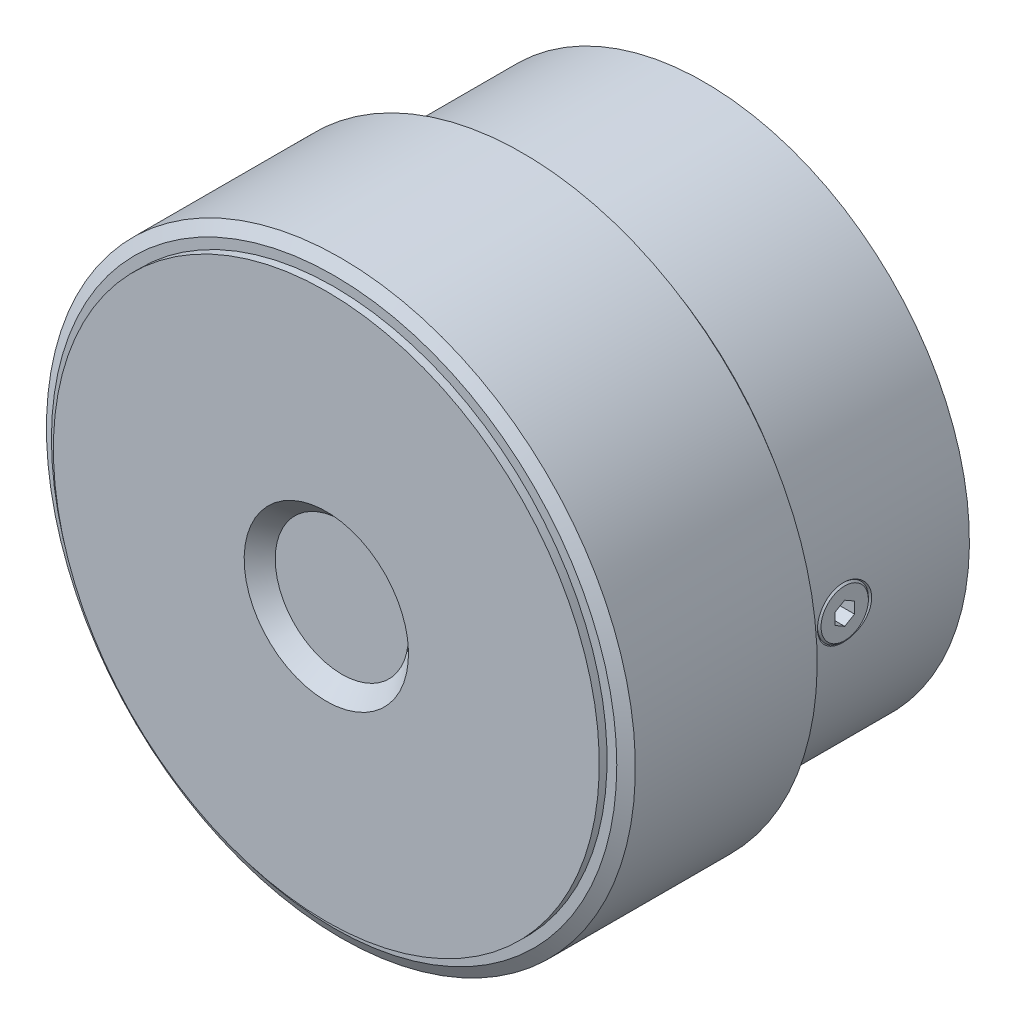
ISO-10303-21;
HEADER;
FILE_DESCRIPTION(('STEP AP214'),'2;1');
FILE_NAME('part.step','',(''),(''),'','','');
FILE_SCHEMA(('AUTOMOTIVE_DESIGN { 1 0 10303 214 1 1 1 1 }'));
ENDSEC;
DATA;
#1=APPLICATION_CONTEXT('core data for automotive mechanical design processes');
#2=APPLICATION_PROTOCOL_DEFINITION('international standard','automotive_design',2000,#1);
#3=PRODUCT_CONTEXT('',#1,'mechanical');
#4=PRODUCT('Part','Part','',(#3));
#5=PRODUCT_RELATED_PRODUCT_CATEGORY('part','',(#4));
#6=PRODUCT_DEFINITION_FORMATION('','',#4);
#7=PRODUCT_DEFINITION_CONTEXT('part definition',#1,'design');
#8=PRODUCT_DEFINITION('design','',#6,#7);
#9=PRODUCT_DEFINITION_SHAPE('','',#8);
#10=(LENGTH_UNIT() NAMED_UNIT(*) SI_UNIT(.MILLI.,.METRE.));
#11=(NAMED_UNIT(*) PLANE_ANGLE_UNIT() SI_UNIT($,.RADIAN.));
#12=(NAMED_UNIT(*) SI_UNIT($,.STERADIAN.) SOLID_ANGLE_UNIT());
#13=UNCERTAINTY_MEASURE_WITH_UNIT(LENGTH_MEASURE(1.E-05),#10,'distance_accuracy_value','');
#14=(GEOMETRIC_REPRESENTATION_CONTEXT(3) GLOBAL_UNCERTAINTY_ASSIGNED_CONTEXT((#13)) GLOBAL_UNIT_ASSIGNED_CONTEXT((#10,
#11,#12)) REPRESENTATION_CONTEXT('',''));
#15=CARTESIAN_POINT('',(0.,0.,0.));
#16=DIRECTION('',(0.,0.,1.));
#17=DIRECTION('',(1.,0.,0.));
#18=AXIS2_PLACEMENT_3D('',#15,#16,#17);
#19=CARTESIAN_POINT('',(0.,0.,22.3094010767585));
#20=DIRECTION('',(0.,0.,1.));
#21=DIRECTION('',(0.,-1.,0.));
#22=AXIS2_PLACEMENT_3D('',#19,#20,#21);
#23=CYLINDRICAL_SURFACE('',#22,4.);
#24=CARTESIAN_POINT('',(0.,0.,0.2));
#25=DIRECTION('',(0.,0.,1.));
#26=DIRECTION('',(0.,-1.,0.));
#27=AXIS2_PLACEMENT_3D('',#24,#25,#26);
#28=CIRCLE('',#27,4.);
#29=CARTESIAN_POINT('',(0.,-4.,0.2));
#30=VERTEX_POINT('',#29);
#31=EDGE_CURVE('E145',#30,#30,#28,.T.);
#32=ORIENTED_EDGE('',*,*,#31,.F.);
#33=EDGE_LOOP('',(#32));
#34=FACE_BOUND('',#33,.T.);
#35=CARTESIAN_POINT('',(0.,0.,20.));
#36=DIRECTION('',(0.,0.,-1.));
#37=DIRECTION('',(0.,1.,0.));
#38=AXIS2_PLACEMENT_3D('',#35,#36,#37);
#39=CIRCLE('',#38,4.);
#40=CARTESIAN_POINT('',(0.,4.,20.));
#41=VERTEX_POINT('',#40);
#42=EDGE_CURVE('E136',#41,#41,#39,.T.);
#43=ORIENTED_EDGE('',*,*,#42,.F.);
#44=EDGE_LOOP('',(#43));
#45=FACE_BOUND('',#44,.T.);
#46=ADVANCED_FACE('F14',(#34,#45),#23,.F.);
#47=CARTESIAN_POINT('',(0.,0.,0.));
#48=DIRECTION('',(0.,0.,-1.));
#49=DIRECTION('',(0.,1.,0.));
#50=AXIS2_PLACEMENT_3D('',#47,#48,#49);
#51=CONICAL_SURFACE('',#50,4.2,0.785398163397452);
#52=ORIENTED_EDGE('',*,*,#31,.T.);
#53=EDGE_LOOP('',(#52));
#54=FACE_BOUND('',#53,.T.);
#55=CARTESIAN_POINT('',(0.,0.,0.));
#56=DIRECTION('',(0.,0.,1.));
#57=DIRECTION('',(0.,-1.,0.));
#58=AXIS2_PLACEMENT_3D('',#55,#56,#57);
#59=CIRCLE('',#58,4.2);
#60=CARTESIAN_POINT('',(0.,-4.2,0.));
#61=VERTEX_POINT('',#60);
#62=EDGE_CURVE('E148',#61,#61,#59,.T.);
#63=ORIENTED_EDGE('',*,*,#62,.F.);
#64=EDGE_LOOP('',(#63));
#65=FACE_BOUND('',#64,.T.);
#66=ADVANCED_FACE('F187',(#54,#65),#51,.F.);
#67=CARTESIAN_POINT('',(0.,0.,0.));
#68=DIRECTION('',(0.,0.,1.));
#69=DIRECTION('',(0.,-1.,0.));
#70=AXIS2_PLACEMENT_3D('',#67,#68,#69);
#71=PLANE('',#70);
#72=CARTESIAN_POINT('',(0.,0.,0.));
#73=DIRECTION('',(0.,0.,1.));
#74=DIRECTION('',(0.,-1.,0.));
#75=AXIS2_PLACEMENT_3D('',#72,#73,#74);
#76=CIRCLE('',#75,7.5);
#77=CARTESIAN_POINT('',(0.,-7.5,0.));
#78=VERTEX_POINT('',#77);
#79=EDGE_CURVE('E98',#78,#78,#76,.T.);
#80=ORIENTED_EDGE('',*,*,#79,.F.);
#81=EDGE_LOOP('',(#80));
#82=FACE_BOUND('',#81,.T.);
#83=ORIENTED_EDGE('',*,*,#62,.T.);
#84=EDGE_LOOP('',(#83));
#85=FACE_BOUND('',#84,.T.);
#86=ADVANCED_FACE('F16',(#82,#85),#71,.F.);
#87=CARTESIAN_POINT('',(20.5,0.,11.5));
#88=DIRECTION('',(1.,0.,0.));
#89=DIRECTION('',(0.,1.,0.));
#90=AXIS2_PLACEMENT_3D('',#87,#88,#89);
#91=PLANE('',#90);
#92=DIRECTION('',(0.,1.,0.));
#93=VECTOR('',#92,1.);
#94=CARTESIAN_POINT('',(20.5,-0.48112522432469,10.6666666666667));
#95=LINE('',#94,#93);
#96=CARTESIAN_POINT('',(20.5,-0.48112522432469,10.6666666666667));
#97=VERTEX_POINT('',#96);
#98=CARTESIAN_POINT('',(20.5,0.481125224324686,10.6666666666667));
#99=VERTEX_POINT('',#98);
#100=EDGE_CURVE('E77',#97,#99,#95,.T.);
#101=ORIENTED_EDGE('',*,*,#100,.T.);
#102=DIRECTION('',(0.,0.5,0.866025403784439));
#103=VECTOR('',#102,1.);
#104=CARTESIAN_POINT('',(20.5,0.481125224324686,10.6666666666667));
#105=LINE('',#104,#103);
#106=CARTESIAN_POINT('',(20.5,0.962250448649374,11.5));
#107=VERTEX_POINT('',#106);
#108=EDGE_CURVE('E84',#99,#107,#105,.T.);
#109=ORIENTED_EDGE('',*,*,#108,.T.);
#110=DIRECTION('',(0.,-0.5,0.866025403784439));
#111=VECTOR('',#110,1.);
#112=CARTESIAN_POINT('',(20.5,0.962250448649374,11.5));
#113=LINE('',#112,#111);
#114=CARTESIAN_POINT('',(20.5,0.481125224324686,12.3333333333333));
#115=VERTEX_POINT('',#114);
#116=EDGE_CURVE('E90',#107,#115,#113,.T.);
#117=ORIENTED_EDGE('',*,*,#116,.T.);
#118=DIRECTION('',(0.,-1.,0.));
#119=VECTOR('',#118,1.);
#120=CARTESIAN_POINT('',(20.5,0.481125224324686,12.3333333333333));
#121=LINE('',#120,#119);
#122=CARTESIAN_POINT('',(20.5,-0.48112522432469,12.3333333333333));
#123=VERTEX_POINT('',#122);
#124=EDGE_CURVE('E102',#115,#123,#121,.T.);
#125=ORIENTED_EDGE('',*,*,#124,.T.);
#126=DIRECTION('',(0.,-0.5,-0.866025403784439));
#127=VECTOR('',#126,1.);
#128=CARTESIAN_POINT('',(20.5,-0.48112522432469,12.3333333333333));
#129=LINE('',#128,#127);
#130=CARTESIAN_POINT('',(20.5,-0.962250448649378,11.5));
#131=VERTEX_POINT('',#130);
#132=EDGE_CURVE('E105',#123,#131,#129,.T.);
#133=ORIENTED_EDGE('',*,*,#132,.T.);
#134=DIRECTION('',(0.,0.5,-0.866025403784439));
#135=VECTOR('',#134,1.);
#136=CARTESIAN_POINT('',(20.5,-0.962250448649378,11.5));
#137=LINE('',#136,#135);
#138=EDGE_CURVE('E95',#131,#97,#137,.T.);
#139=ORIENTED_EDGE('',*,*,#138,.T.);
#140=EDGE_LOOP('',(#101,#109,#117,#125,#133,#139));
#141=FACE_BOUND('',#140,.T.);
#142=ADVANCED_FACE('F93',(#141),#91,.T.);
#143=CARTESIAN_POINT('',(0.,0.,33.));
#144=DIRECTION('',(0.,0.,1.));
#145=DIRECTION('',(0.,-1.,0.));
#146=AXIS2_PLACEMENT_3D('',#143,#144,#145);
#147=CYLINDRICAL_SURFACE('',#146,7.5);
#148=CARTESIAN_POINT('',(0.,0.,0.3));
#149=DIRECTION('',(0.,0.,1.));
#150=DIRECTION('',(0.,-1.,0.));
#151=AXIS2_PLACEMENT_3D('',#148,#149,#150);
#152=CIRCLE('',#151,7.5);
#153=CARTESIAN_POINT('',(0.,-7.5,0.3));
#154=VERTEX_POINT('',#153);
#155=EDGE_CURVE('E178',#154,#154,#152,.T.);
#156=ORIENTED_EDGE('',*,*,#155,.F.);
#157=EDGE_LOOP('',(#156));
#158=FACE_BOUND('',#157,.T.);
#159=ORIENTED_EDGE('',*,*,#79,.T.);
#160=EDGE_LOOP('',(#159));
#161=FACE_BOUND('',#160,.T.);
#162=ADVANCED_FACE('F183',(#158,#161),#147,.T.);
#163=CARTESIAN_POINT('',(24.5,0.481125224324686,10.6666666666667));
#164=DIRECTION('',(0.,-0.866025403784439,0.5));
#165=DIRECTION('',(0.,-0.5,-0.866025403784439));
#166=AXIS2_PLACEMENT_3D('',#163,#164,#165);
#167=PLANE('',#166);
#168=DIRECTION('',(0.,0.5,0.866025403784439));
#169=VECTOR('',#168,1.);
#170=CARTESIAN_POINT('',(22.5097826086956,0.72168783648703,11.0833333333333));
#171=LINE('',#170,#169);
#172=CARTESIAN_POINT('',(22.5097826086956,0.481125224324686,10.6666666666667));
#173=VERTEX_POINT('',#172);
#174=CARTESIAN_POINT('',(22.5097826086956,0.962250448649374,11.5));
#175=VERTEX_POINT('',#174);
#176=EDGE_CURVE('E127',#173,#175,#171,.T.);
#177=ORIENTED_EDGE('',*,*,#176,.T.);
#178=DIRECTION('',(-1.,0.,0.));
#179=VECTOR('',#178,1.);
#180=CARTESIAN_POINT('',(24.5,0.962250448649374,11.5));
#181=LINE('',#180,#179);
#182=EDGE_CURVE('E81',#175,#107,#181,.T.);
#183=ORIENTED_EDGE('',*,*,#182,.T.);
#184=ORIENTED_EDGE('',*,*,#108,.F.);
#185=DIRECTION('',(-1.,0.,0.));
#186=VECTOR('',#185,1.);
#187=CARTESIAN_POINT('',(24.5,0.481125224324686,10.6666666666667));
#188=LINE('',#187,#186);
#189=EDGE_CURVE('E73',#173,#99,#188,.T.);
#190=ORIENTED_EDGE('',*,*,#189,.F.);
#191=EDGE_LOOP('',(#177,#183,#184,#190));
#192=FACE_BOUND('',#191,.T.);
#193=ADVANCED_FACE('F85',(#192),#167,.T.);
#194=CARTESIAN_POINT('',(24.5,0.962250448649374,11.5));
#195=DIRECTION('',(0.,-0.866025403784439,-0.5));
#196=DIRECTION('',(0.,0.5,-0.866025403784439));
#197=AXIS2_PLACEMENT_3D('',#194,#195,#196);
#198=PLANE('',#197);
#199=DIRECTION('',(0.,-0.5,0.866025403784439));
#200=VECTOR('',#199,1.);
#201=CARTESIAN_POINT('',(22.5097826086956,0.72168783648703,11.9166666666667));
#202=LINE('',#201,#200);
#203=CARTESIAN_POINT('',(22.5097826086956,0.481125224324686,12.3333333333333));
#204=VERTEX_POINT('',#203);
#205=EDGE_CURVE('E124',#175,#204,#202,.T.);
#206=ORIENTED_EDGE('',*,*,#205,.T.);
#207=DIRECTION('',(-1.,0.,0.));
#208=VECTOR('',#207,1.);
#209=CARTESIAN_POINT('',(24.5,0.481125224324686,12.3333333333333));
#210=LINE('',#209,#208);
#211=EDGE_CURVE('E113',#204,#115,#210,.T.);
#212=ORIENTED_EDGE('',*,*,#211,.T.);
#213=ORIENTED_EDGE('',*,*,#116,.F.);
#214=ORIENTED_EDGE('',*,*,#182,.F.);
#215=EDGE_LOOP('',(#206,#212,#213,#214));
#216=FACE_BOUND('',#215,.T.);
#217=ADVANCED_FACE('F254',(#216),#198,.T.);
#218=CARTESIAN_POINT('',(24.5,0.481125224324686,12.3333333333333));
#219=DIRECTION('',(0.,0.,-1.));
#220=DIRECTION('',(0.,1.,0.));
#221=AXIS2_PLACEMENT_3D('',#218,#219,#220);
#222=PLANE('',#221);
#223=ORIENTED_EDGE('',*,*,#211,.F.);
#224=DIRECTION('',(0.,-1.,0.));
#225=VECTOR('',#224,1.);
#226=CARTESIAN_POINT('',(22.5097826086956,0.,12.3333333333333));
#227=LINE('',#226,#225);
#228=CARTESIAN_POINT('',(22.5097826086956,-0.48112522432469,12.3333333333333));
#229=VERTEX_POINT('',#228);
#230=EDGE_CURVE('E122',#204,#229,#227,.T.);
#231=ORIENTED_EDGE('',*,*,#230,.T.);
#232=DIRECTION('',(-1.,0.,0.));
#233=VECTOR('',#232,1.);
#234=CARTESIAN_POINT('',(24.5,-0.48112522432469,12.3333333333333));
#235=LINE('',#234,#233);
#236=EDGE_CURVE('E111',#229,#123,#235,.T.);
#237=ORIENTED_EDGE('',*,*,#236,.T.);
#238=ORIENTED_EDGE('',*,*,#124,.F.);
#239=EDGE_LOOP('',(#223,#231,#237,#238));
#240=FACE_BOUND('',#239,.T.);
#241=ADVANCED_FACE('F276',(#240),#222,.T.);
#242=CARTESIAN_POINT('',(24.5,-0.48112522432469,12.3333333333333));
#243=DIRECTION('',(0.,0.866025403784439,-0.5));
#244=DIRECTION('',(0.,0.5,0.866025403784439));
#245=AXIS2_PLACEMENT_3D('',#242,#243,#244);
#246=PLANE('',#245);
#247=DIRECTION('',(0.,-0.5,-0.866025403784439));
#248=VECTOR('',#247,1.);
#249=CARTESIAN_POINT('',(22.5097826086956,-0.721687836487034,11.9166666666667));
#250=LINE('',#249,#248);
#251=CARTESIAN_POINT('',(22.5097826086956,-0.962250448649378,11.5));
#252=VERTEX_POINT('',#251);
#253=EDGE_CURVE('E120',#229,#252,#250,.T.);
#254=ORIENTED_EDGE('',*,*,#253,.T.);
#255=DIRECTION('',(-1.,0.,0.));
#256=VECTOR('',#255,1.);
#257=CARTESIAN_POINT('',(24.5,-0.962250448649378,11.5));
#258=LINE('',#257,#256);
#259=EDGE_CURVE('E36',#252,#131,#258,.T.);
#260=ORIENTED_EDGE('',*,*,#259,.T.);
#261=ORIENTED_EDGE('',*,*,#132,.F.);
#262=ORIENTED_EDGE('',*,*,#236,.F.);
#263=EDGE_LOOP('',(#254,#260,#261,#262));
#264=FACE_BOUND('',#263,.T.);
#265=ADVANCED_FACE('F270',(#264),#246,.T.);
#266=CARTESIAN_POINT('',(24.5,-0.962250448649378,11.5));
#267=DIRECTION('',(0.,0.866025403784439,0.5));
#268=DIRECTION('',(0.,-0.5,0.866025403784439));
#269=AXIS2_PLACEMENT_3D('',#266,#267,#268);
#270=PLANE('',#269);
#271=DIRECTION('',(0.,0.5,-0.866025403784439));
#272=VECTOR('',#271,1.);
#273=CARTESIAN_POINT('',(22.5097826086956,-0.721687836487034,11.0833333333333));
#274=LINE('',#273,#272);
#275=CARTESIAN_POINT('',(22.5097826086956,-0.48112522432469,10.6666666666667));
#276=VERTEX_POINT('',#275);
#277=EDGE_CURVE('E118',#252,#276,#274,.T.);
#278=ORIENTED_EDGE('',*,*,#277,.T.);
#279=DIRECTION('',(-1.,0.,0.));
#280=VECTOR('',#279,1.);
#281=CARTESIAN_POINT('',(24.5,-0.48112522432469,10.6666666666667));
#282=LINE('',#281,#280);
#283=EDGE_CURVE('E108',#276,#97,#282,.T.);
#284=ORIENTED_EDGE('',*,*,#283,.T.);
#285=ORIENTED_EDGE('',*,*,#138,.F.);
#286=ORIENTED_EDGE('',*,*,#259,.F.);
#287=EDGE_LOOP('',(#278,#284,#285,#286));
#288=FACE_BOUND('',#287,.T.);
#289=ADVANCED_FACE('F258',(#288),#270,.T.);
#290=CARTESIAN_POINT('',(24.5,-0.48112522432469,10.6666666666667));
#291=DIRECTION('',(0.,0.,1.));
#292=DIRECTION('',(0.,-1.,0.));
#293=AXIS2_PLACEMENT_3D('',#290,#291,#292);
#294=PLANE('',#293);
#295=DIRECTION('',(0.,1.,0.));
#296=VECTOR('',#295,1.);
#297=CARTESIAN_POINT('',(22.5097826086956,0.,10.6666666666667));
#298=LINE('',#297,#296);
#299=EDGE_CURVE('E44',#276,#173,#298,.T.);
#300=ORIENTED_EDGE('',*,*,#299,.T.);
#301=ORIENTED_EDGE('',*,*,#189,.T.);
#302=ORIENTED_EDGE('',*,*,#100,.F.);
#303=ORIENTED_EDGE('',*,*,#283,.F.);
#304=EDGE_LOOP('',(#300,#301,#302,#303));
#305=FACE_BOUND('',#304,.T.);
#306=ADVANCED_FACE('F75',(#305),#294,.T.);
#307=CARTESIAN_POINT('',(7.5,0.,0.3));
#308=DIRECTION('',(0.,0.,1.));
#309=DIRECTION('',(0.,-1.,0.));
#310=AXIS2_PLACEMENT_3D('',#307,#308,#309);
#311=PLANE('',#310);
#312=CARTESIAN_POINT('',(0.,0.,0.3));
#313=DIRECTION('',(0.,0.,1.));
#314=DIRECTION('',(0.,-1.,0.));
#315=AXIS2_PLACEMENT_3D('',#312,#313,#314);
#316=CIRCLE('',#315,10.);
#317=CARTESIAN_POINT('',(0.,-10.,0.3));
#318=VERTEX_POINT('',#317);
#319=EDGE_CURVE('E175',#318,#318,#316,.T.);
#320=ORIENTED_EDGE('',*,*,#319,.F.);
#321=EDGE_LOOP('',(#320));
#322=FACE_BOUND('',#321,.T.);
#323=ORIENTED_EDGE('',*,*,#155,.T.);
#324=EDGE_LOOP('',(#323));
#325=FACE_BOUND('',#324,.T.);
#326=ADVANCED_FACE('F245',(#322,#325),#311,.F.);
#327=CARTESIAN_POINT('',(22.5097826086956,0.,11.5));
#328=DIRECTION('',(-1.,0.,0.));
#329=DIRECTION('',(0.,-1.,0.));
#330=AXIS2_PLACEMENT_3D('',#327,#328,#329);
#331=PLANE('',#330);
#332=CARTESIAN_POINT('',(22.5097826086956,0.,11.5));
#333=DIRECTION('',(-1.,0.,0.));
#334=DIRECTION('',(0.,-1.,0.));
#335=AXIS2_PLACEMENT_3D('',#332,#333,#334);
#336=CIRCLE('',#335,2.0095);
#337=CARTESIAN_POINT('',(22.5097826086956,-2.0095,11.5));
#338=VERTEX_POINT('',#337);
#339=EDGE_CURVE('E80',#338,#338,#336,.T.);
#340=ORIENTED_EDGE('',*,*,#339,.F.);
#341=EDGE_LOOP('',(#340));
#342=FACE_BOUND('',#341,.T.);
#343=ORIENTED_EDGE('',*,*,#299,.F.);
#344=ORIENTED_EDGE('',*,*,#277,.F.);
#345=ORIENTED_EDGE('',*,*,#253,.F.);
#346=ORIENTED_EDGE('',*,*,#230,.F.);
#347=ORIENTED_EDGE('',*,*,#205,.F.);
#348=ORIENTED_EDGE('',*,*,#176,.F.);
#349=EDGE_LOOP('',(#343,#344,#345,#346,#347,#348));
#350=FACE_BOUND('',#349,.T.);
#351=ADVANCED_FACE('F243',(#342,#350),#331,.F.);
#352=CARTESIAN_POINT('',(0.,0.,33.));
#353=DIRECTION('',(0.,0.,1.));
#354=DIRECTION('',(0.,-1.,0.));
#355=AXIS2_PLACEMENT_3D('',#352,#353,#354);
#356=CYLINDRICAL_SURFACE('',#355,10.);
#357=CARTESIAN_POINT('',(0.,0.,0.9));
#358=DIRECTION('',(0.,0.,1.));
#359=DIRECTION('',(0.,-1.,0.));
#360=AXIS2_PLACEMENT_3D('',#357,#358,#359);
#361=CIRCLE('',#360,10.);
#362=CARTESIAN_POINT('',(0.,-10.,0.9));
#363=VERTEX_POINT('',#362);
#364=EDGE_CURVE('E172',#363,#363,#361,.T.);
#365=ORIENTED_EDGE('',*,*,#364,.F.);
#366=EDGE_LOOP('',(#365));
#367=FACE_BOUND('',#366,.T.);
#368=ORIENTED_EDGE('',*,*,#319,.T.);
#369=EDGE_LOOP('',(#368));
#370=FACE_BOUND('',#369,.T.);
#371=ADVANCED_FACE('F219',(#367,#370),#356,.T.);
#372=CARTESIAN_POINT('',(22.5097826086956,0.,11.5));
#373=DIRECTION('',(-1.,0.,0.));
#374=DIRECTION('',(0.,-1.,0.));
#375=AXIS2_PLACEMENT_3D('',#372,#373,#374);
#376=CONICAL_SURFACE('',#375,2.0095,0.785398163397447);
#377=CARTESIAN_POINT('',(22.3596413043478,0.,11.5));
#378=DIRECTION('',(1.,0.,0.));
#379=DIRECTION('',(0.,0.,-1.));
#380=AXIS2_PLACEMENT_3D('',#377,#378,#379);
#381=CIRCLE('',#380,2.15964130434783);
#382=CARTESIAN_POINT('',(22.3596413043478,0.,9.34035869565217));
#383=VERTEX_POINT('',#382);
#384=EDGE_CURVE('E28',#383,#383,#381,.T.);
#385=ORIENTED_EDGE('',*,*,#384,.T.);
#386=EDGE_LOOP('',(#385));
#387=FACE_BOUND('',#386,.T.);
#388=ORIENTED_EDGE('',*,*,#339,.T.);
#389=EDGE_LOOP('',(#388));
#390=FACE_BOUND('',#389,.T.);
#391=ADVANCED_FACE('F216',(#387,#390),#376,.T.);
#392=CARTESIAN_POINT('',(10.,0.,0.9));
#393=DIRECTION('',(0.,0.,1.));
#394=DIRECTION('',(0.,-1.,0.));
#395=AXIS2_PLACEMENT_3D('',#392,#393,#394);
#396=PLANE('',#395);
#397=CARTESIAN_POINT('',(0.,0.,0.9));
#398=DIRECTION('',(0.,0.,1.));
#399=DIRECTION('',(0.,-1.,0.));
#400=AXIS2_PLACEMENT_3D('',#397,#398,#399);
#401=CIRCLE('',#400,22.5);
#402=CARTESIAN_POINT('',(0.,-22.5,0.9));
#403=VERTEX_POINT('',#402);
#404=EDGE_CURVE('E169',#403,#403,#401,.T.);
#405=ORIENTED_EDGE('',*,*,#404,.F.);
#406=EDGE_LOOP('',(#405));
#407=FACE_BOUND('',#406,.T.);
#408=ORIENTED_EDGE('',*,*,#364,.T.);
#409=EDGE_LOOP('',(#408));
#410=FACE_BOUND('',#409,.T.);
#411=ADVANCED_FACE('F209',(#407,#410),#396,.F.);
#412=CARTESIAN_POINT('',(22.7,0.,11.5));
#413=DIRECTION('',(1.,0.,0.));
#414=DIRECTION('',(0.,0.,-1.));
#415=AXIS2_PLACEMENT_3D('',#412,#413,#414);
#416=CONICAL_SURFACE('',#415,2.5,0.785398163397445);
#417=CARTESIAN_POINT('',(22.4449005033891,-1.57367131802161,9.89902003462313));
#418=CARTESIAN_POINT('',(22.4501885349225,-1.49824527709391,9.81746639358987));
#419=CARTESIAN_POINT('',(22.4555177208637,-1.41678298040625,9.74147847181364));
#420=CARTESIAN_POINT('',(22.4657900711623,-1.24331217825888,9.60255135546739));
#421=CARTESIAN_POINT('',(22.470733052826,-1.15129873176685,9.53961831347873));
#422=CARTESIAN_POINT('',(22.4803216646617,-0.946988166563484,9.42188347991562));
#423=CARTESIAN_POINT('',(22.4848595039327,-0.833583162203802,9.3689782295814));
#424=CARTESIAN_POINT('',(22.4923255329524,-0.599185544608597,9.28386215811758));
#425=CARTESIAN_POINT('',(22.4952536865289,-0.478192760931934,9.25165180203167));
#426=CARTESIAN_POINT('',(22.499053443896,-0.237595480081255,9.21014008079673));
#427=CARTESIAN_POINT('',(22.5000069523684,-0.118149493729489,9.19992560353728));
#428=CARTESIAN_POINT('',(22.4999929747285,0.120711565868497,9.20007518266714));
#429=CARTESIAN_POINT('',(22.4990258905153,0.240126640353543,9.21043493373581));
#430=CARTESIAN_POINT('',(22.4953234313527,0.472989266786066,9.25089596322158));
#431=CARTESIAN_POINT('',(22.4926247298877,0.5865089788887,9.28058799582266));
#432=CARTESIAN_POINT('',(22.4857918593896,0.807062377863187,9.35823586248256));
#433=CARTESIAN_POINT('',(22.4816575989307,0.9140956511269,9.40619285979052));
#434=CARTESIAN_POINT('',(22.4723134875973,1.12072305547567,9.51972202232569));
#435=CARTESIAN_POINT('',(22.4670863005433,1.22015686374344,9.58558399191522));
#436=CARTESIAN_POINT('',(22.4561529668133,1.40711810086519,9.7324165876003));
#437=CARTESIAN_POINT('',(22.4504467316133,1.49464332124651,9.81339000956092));
#438=CARTESIAN_POINT('',(22.4388879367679,1.65934563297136,9.99184784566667));
#439=CARTESIAN_POINT('',(22.4330396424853,1.73591558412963,10.0898926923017));
#440=CARTESIAN_POINT('',(22.4220639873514,1.87236355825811,10.2970114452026));
#441=CARTESIAN_POINT('',(22.4169367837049,1.93223794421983,10.4060877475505));
#442=CARTESIAN_POINT('',(22.4077217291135,2.03638851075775,10.6374772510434));
#443=CARTESIAN_POINT('',(22.4036914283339,2.07983597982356,10.7601661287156));
#444=CARTESIAN_POINT('',(22.3974264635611,2.1462538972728,11.011012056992));
#445=CARTESIAN_POINT('',(22.3951921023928,2.16922089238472,11.1391700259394));
#446=CARTESIAN_POINT('',(22.3927228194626,2.19457076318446,11.4013368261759));
#447=CARTESIAN_POINT('',(22.3925485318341,2.19632944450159,11.535406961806));
#448=CARTESIAN_POINT('',(22.394377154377,2.17760329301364,11.8019791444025));
#449=CARTESIAN_POINT('',(22.3963802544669,2.15711651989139,11.9344810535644));
#450=CARTESIAN_POINT('',(22.4023598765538,2.09410479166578,12.1951352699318));
#451=CARTESIAN_POINT('',(22.4063507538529,2.05141942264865,12.3232485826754));
#452=CARTESIAN_POINT('',(22.4158499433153,1.94486944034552,12.5703021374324));
#453=CARTESIAN_POINT('',(22.4213582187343,1.88100533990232,12.6892426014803));
#454=CARTESIAN_POINT('',(22.4331417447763,1.73477050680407,12.9124375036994));
#455=CARTESIAN_POINT('',(22.4394035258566,1.65270760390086,13.0168940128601));
#456=CARTESIAN_POINT('',(22.4520098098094,1.47155370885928,13.2098357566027));
#457=CARTESIAN_POINT('',(22.4583542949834,1.37246630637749,13.29832435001));
#458=CARTESIAN_POINT('',(22.470099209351,1.16408331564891,13.4530531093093));
#459=CARTESIAN_POINT('',(22.4755266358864,1.05532978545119,13.5200205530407));
#460=CARTESIAN_POINT('',(22.4850604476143,0.827649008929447,13.633694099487));
#461=CARTESIAN_POINT('',(22.4891672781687,0.708725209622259,13.6804070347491));
#462=CARTESIAN_POINT('',(22.4953843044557,0.470322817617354,13.7499424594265));
#463=CARTESIAN_POINT('',(22.4975819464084,0.351152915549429,13.7738170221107));
#464=CARTESIAN_POINT('',(22.5000502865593,0.110467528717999,13.8005822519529));
#465=CARTESIAN_POINT('',(22.500321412,-0.0110474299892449,13.8034775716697));
#466=CARTESIAN_POINT('',(22.4989278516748,-0.248912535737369,13.7884205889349));
#467=CARTESIAN_POINT('',(22.4973237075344,-0.365305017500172,13.7711203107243));
#468=CARTESIAN_POINT('',(22.492459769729,-0.593539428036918,13.7173905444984));
#469=CARTESIAN_POINT('',(22.4891999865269,-0.705381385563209,13.6809611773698));
#470=CARTESIAN_POINT('',(22.4813606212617,-0.922094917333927,13.5900276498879));
#471=CARTESIAN_POINT('',(22.4767740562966,-1.02692590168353,13.5354276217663));
#472=CARTESIAN_POINT('',(22.466776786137,-1.22634675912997,13.4100275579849));
#473=CARTESIAN_POINT('',(22.461365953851,-1.32093504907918,13.3392250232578));
#474=CARTESIAN_POINT('',(22.4500659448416,-1.50099631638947,13.1806812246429));
#475=CARTESIAN_POINT('',(22.4441664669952,-1.58600048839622,13.0924086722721));
#476=CARTESIAN_POINT('',(22.4326929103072,-1.74078361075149,12.9033846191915));
#477=CARTESIAN_POINT('',(22.4271189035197,-1.81055919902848,12.8026303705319));
#478=CARTESIAN_POINT('',(22.4166176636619,-1.93634626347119,12.5864126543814));
#479=CARTESIAN_POINT('',(22.4117332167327,-1.99155539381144,12.4704800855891));
#480=CARTESIAN_POINT('',(22.4034617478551,-2.08254577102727,12.2311797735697));
#481=CARTESIAN_POINT('',(22.4000749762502,-2.11832377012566,12.1078107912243));
#482=CARTESIAN_POINT('',(22.3950672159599,-2.17064320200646,11.8524275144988));
#483=CARTESIAN_POINT('',(22.3935134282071,-2.18645396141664,11.7202618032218));
#484=CARTESIAN_POINT('',(22.3925674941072,-2.19612012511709,11.455095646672));
#485=CARTESIAN_POINT('',(22.3931758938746,-2.1899699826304,11.3220949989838));
#486=CARTESIAN_POINT('',(22.3965122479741,-2.15558362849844,11.0569945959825));
#487=CARTESIAN_POINT('',(22.3992714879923,-2.12702137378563,10.9249374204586));
#488=CARTESIAN_POINT('',(22.4066309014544,-2.04803684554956,10.6676306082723));
#489=CARTESIAN_POINT('',(22.4112299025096,-1.99762849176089,10.5423766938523));
#490=CARTESIAN_POINT('',(22.4206352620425,-1.88876288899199,10.3273285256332));
#491=CARTESIAN_POINT('',(22.4252012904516,-1.83413642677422,10.2355638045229));
#492=CARTESIAN_POINT('',(22.4347992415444,-1.71274280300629,10.0605034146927));
#493=CARTESIAN_POINT('',(22.4398309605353,-1.64598093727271,9.97720407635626));
#494=CARTESIAN_POINT('',(22.4449005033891,-1.57367131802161,9.89902003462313));
#495=B_SPLINE_CURVE_WITH_KNOTS('',3,(#417,#418,#419,#420,#421,#422,#423,#424,#425,#426,#427,
#428,#429,#430,#431,#432,#433,#434,#435,#436,#437,#438,#439,#440,#441,#442,#443,#444,#445,#446,
#447,#448,#449,#450,#451,#452,#453,#454,#455,#456,#457,#458,#459,#460,#461,#462,#463,#464,#465,
#466,#467,#468,#469,#470,#471,#472,#473,#474,#475,#476,#477,#478,#479,#480,#481,#482,#483,#484,
#485,#486,#487,#488,#489,#490,#491,#492,#493,#494),.UNSPECIFIED.,.T.,.F.,(4,2,2,2,2,2,2,2,2,2,2,
2,2,2,2,2,2,2,2,2,2,2,2,2,2,2,2,2,2,2,2,2,2,2,2,2,2,2,4),(0.,0.333338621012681,
0.666833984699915,1.04055735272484,1.41428911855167,1.77218063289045,2.12999726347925,
2.48047526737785,2.8309755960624,3.18752673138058,3.54414389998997,3.91610231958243,
4.28814170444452,4.67702111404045,5.06596608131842,5.46633130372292,5.86673145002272,
6.27006606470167,6.67339091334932,7.07035341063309,7.46723230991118,7.84878311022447,
8.23020509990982,8.59306372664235,8.95584187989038,9.3072241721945,9.65860424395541,
10.0118683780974,10.3651870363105,10.7316233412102,11.098140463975,11.481907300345,
11.8657382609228,12.2632425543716,12.6608472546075,13.0643458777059,13.4675877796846,
13.7872928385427,14.1068587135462),.UNSPECIFIED.);
#496=CARTESIAN_POINT('',(22.4449005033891,-1.57367131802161,9.89902003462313));
#497=VERTEX_POINT('',#496);
#498=EDGE_CURVE('E18',#497,#497,#495,.T.);
#499=ORIENTED_EDGE('',*,*,#498,.T.);
#500=EDGE_LOOP('',(#499));
#501=FACE_BOUND('',#500,.T.);
#502=ORIENTED_EDGE('',*,*,#384,.F.);
#503=EDGE_LOOP('',(#502));
#504=FACE_BOUND('',#503,.T.);
#505=ADVANCED_FACE('F207',(#501,#504),#416,.F.);
#506=CARTESIAN_POINT('',(0.,0.,33.));
#507=DIRECTION('',(0.,0.,1.));
#508=DIRECTION('',(0.,-1.,0.));
#509=AXIS2_PLACEMENT_3D('',#506,#507,#508);
#510=CYLINDRICAL_SURFACE('',#509,22.5);
#511=CARTESIAN_POINT('',(0.,0.,15.));
#512=DIRECTION('',(0.,0.,1.));
#513=DIRECTION('',(0.,-1.,0.));
#514=AXIS2_PLACEMENT_3D('',#511,#512,#513);
#515=CIRCLE('',#514,22.5);
#516=CARTESIAN_POINT('',(0.,-22.5,15.));
#517=VERTEX_POINT('',#516);
#518=EDGE_CURVE('E166',#517,#517,#515,.T.);
#519=ORIENTED_EDGE('',*,*,#518,.F.);
#520=EDGE_LOOP('',(#519));
#521=FACE_BOUND('',#520,.T.);
#522=ORIENTED_EDGE('',*,*,#498,.F.);
#523=EDGE_LOOP('',(#522));
#524=FACE_BOUND('',#523,.T.);
#525=ORIENTED_EDGE('',*,*,#404,.T.);
#526=EDGE_LOOP('',(#525));
#527=FACE_BOUND('',#526,.T.);
#528=ADVANCED_FACE('F188',(#521,#524,#527),#510,.T.);
#529=CARTESIAN_POINT('',(22.5,0.,15.));
#530=DIRECTION('',(0.,0.,1.));
#531=DIRECTION('',(0.,-1.,0.));
#532=AXIS2_PLACEMENT_3D('',#529,#530,#531);
#533=PLANE('',#532);
#534=CARTESIAN_POINT('',(0.,0.,15.));
#535=DIRECTION('',(0.,0.,1.));
#536=DIRECTION('',(0.,-1.,0.));
#537=AXIS2_PLACEMENT_3D('',#534,#535,#536);
#538=CIRCLE('',#537,23.175);
#539=CARTESIAN_POINT('',(0.,-23.175,15.));
#540=VERTEX_POINT('',#539);
#541=EDGE_CURVE('E163',#540,#540,#538,.T.);
#542=ORIENTED_EDGE('',*,*,#541,.F.);
#543=EDGE_LOOP('',(#542));
#544=FACE_BOUND('',#543,.T.);
#545=ORIENTED_EDGE('',*,*,#518,.T.);
#546=EDGE_LOOP('',(#545));
#547=FACE_BOUND('',#546,.T.);
#548=ADVANCED_FACE('F204',(#544,#547),#533,.F.);
#549=CARTESIAN_POINT('',(0.,0.,33.));
#550=DIRECTION('',(0.,0.,1.));
#551=DIRECTION('',(0.,-1.,0.));
#552=AXIS2_PLACEMENT_3D('',#549,#550,#551);
#553=CYLINDRICAL_SURFACE('',#552,23.175);
#554=CARTESIAN_POINT('',(0.,0.,15.75));
#555=DIRECTION('',(0.,0.,1.));
#556=DIRECTION('',(0.,-1.,0.));
#557=AXIS2_PLACEMENT_3D('',#554,#555,#556);
#558=CIRCLE('',#557,23.175);
#559=CARTESIAN_POINT('',(0.,-23.175,15.75));
#560=VERTEX_POINT('',#559);
#561=EDGE_CURVE('E160',#560,#560,#558,.T.);
#562=ORIENTED_EDGE('',*,*,#561,.F.);
#563=EDGE_LOOP('',(#562));
#564=FACE_BOUND('',#563,.T.);
#565=ORIENTED_EDGE('',*,*,#541,.T.);
#566=EDGE_LOOP('',(#565));
#567=FACE_BOUND('',#566,.T.);
#568=ADVANCED_FACE('F194',(#564,#567),#553,.T.);
#569=CARTESIAN_POINT('',(23.175,0.,15.75));
#570=DIRECTION('',(0.,0.,1.));
#571=DIRECTION('',(0.,-1.,0.));
#572=AXIS2_PLACEMENT_3D('',#569,#570,#571);
#573=PLANE('',#572);
#574=CARTESIAN_POINT('',(0.,0.,15.75));
#575=DIRECTION('',(0.,0.,1.));
#576=DIRECTION('',(0.,-1.,0.));
#577=AXIS2_PLACEMENT_3D('',#574,#575,#576);
#578=CIRCLE('',#577,24.);
#579=CARTESIAN_POINT('',(0.,-24.,15.75));
#580=VERTEX_POINT('',#579);
#581=EDGE_CURVE('E135',#580,#580,#578,.T.);
#582=ORIENTED_EDGE('',*,*,#581,.F.);
#583=EDGE_LOOP('',(#582));
#584=FACE_BOUND('',#583,.T.);
#585=ORIENTED_EDGE('',*,*,#561,.T.);
#586=EDGE_LOOP('',(#585));
#587=FACE_BOUND('',#586,.T.);
#588=ADVANCED_FACE('F203',(#584,#587),#573,.F.);
#589=CARTESIAN_POINT('',(0.,0.,15.75));
#590=DIRECTION('',(0.,0.,1.));
#591=DIRECTION('',(0.,-1.,0.));
#592=AXIS2_PLACEMENT_3D('',#589,#590,#591);
#593=CONICAL_SURFACE('',#592,24.,1.0471975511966);
#594=CARTESIAN_POINT('',(0.,0.,16.3273502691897));
#595=DIRECTION('',(0.,0.,1.));
#596=DIRECTION('',(0.,-1.,0.));
#597=AXIS2_PLACEMENT_3D('',#594,#595,#596);
#598=CIRCLE('',#597,25.);
#599=CARTESIAN_POINT('',(0.,-25.,16.3273502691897));
#600=VERTEX_POINT('',#599);
#601=EDGE_CURVE('E142',#600,#600,#598,.T.);
#602=ORIENTED_EDGE('',*,*,#601,.F.);
#603=EDGE_LOOP('',(#602));
#604=FACE_BOUND('',#603,.T.);
#605=ORIENTED_EDGE('',*,*,#581,.T.);
#606=EDGE_LOOP('',(#605));
#607=FACE_BOUND('',#606,.T.);
#608=ADVANCED_FACE('F201',(#604,#607),#593,.T.);
#609=CARTESIAN_POINT('',(0.,0.,33.));
#610=DIRECTION('',(0.,0.,1.));
#611=DIRECTION('',(0.,-1.,0.));
#612=AXIS2_PLACEMENT_3D('',#609,#610,#611);
#613=CYLINDRICAL_SURFACE('',#612,25.);
#614=ORIENTED_EDGE('',*,*,#601,.T.);
#615=EDGE_LOOP('',(#614));
#616=FACE_BOUND('',#615,.T.);
#617=CARTESIAN_POINT('',(0.,0.,31.7626497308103));
#618=DIRECTION('',(0.,0.,-1.));
#619=DIRECTION('',(0.,1.,0.));
#620=AXIS2_PLACEMENT_3D('',#617,#618,#619);
#621=CIRCLE('',#620,25.);
#622=CARTESIAN_POINT('',(0.,25.,31.7626497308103));
#623=VERTEX_POINT('',#622);
#624=EDGE_CURVE('E139',#623,#623,#621,.T.);
#625=ORIENTED_EDGE('',*,*,#624,.T.);
#626=EDGE_LOOP('',(#625));
#627=FACE_BOUND('',#626,.T.);
#628=ADVANCED_FACE('F229',(#616,#627),#613,.T.);
#629=CARTESIAN_POINT('',(0.,0.,20.));
#630=DIRECTION('',(0.,0.,-1.));
#631=DIRECTION('',(0.,1.,0.));
#632=AXIS2_PLACEMENT_3D('',#629,#630,#631);
#633=PLANE('',#632);
#634=ORIENTED_EDGE('',*,*,#42,.T.);
#635=EDGE_LOOP('',(#634));
#636=FACE_BOUND('',#635,.T.);
#637=ADVANCED_FACE('F257',(#636),#633,.T.);
#638=CARTESIAN_POINT('',(5.97674418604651,0.,31.68));
#639=DIRECTION('',(0.,0.,-1.));
#640=DIRECTION('',(0.,1.,0.));
#641=AXIS2_PLACEMENT_3D('',#638,#639,#640);
#642=PLANE('',#641);
#643=CARTESIAN_POINT('',(0.,0.,31.68));
#644=DIRECTION('',(0.,0.,-1.));
#645=DIRECTION('',(0.,1.,0.));
#646=AXIS2_PLACEMENT_3D('',#643,#644,#645);
#647=CIRCLE('',#646,5.65674418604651);
#648=CARTESIAN_POINT('',(0.,5.65674418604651,31.68));
#649=VERTEX_POINT('',#648);
#650=EDGE_CURVE('E9',#649,#649,#647,.T.);
#651=ORIENTED_EDGE('',*,*,#650,.F.);
#652=EDGE_LOOP('',(#651));
#653=FACE_BOUND('',#652,.T.);
#654=ADVANCED_FACE('F266',(#653),#642,.F.);
#655=CARTESIAN_POINT('',(0.,0.,33.));
#656=DIRECTION('',(0.,0.,1.));
#657=DIRECTION('',(0.,-1.,0.));
#658=AXIS2_PLACEMENT_3D('',#655,#656,#657);
#659=CONICAL_SURFACE('',#658,6.97674418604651,0.785398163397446);
#660=ORIENTED_EDGE('',*,*,#650,.T.);
#661=EDGE_LOOP('',(#660));
#662=FACE_BOUND('',#661,.T.);
#663=CARTESIAN_POINT('',(0.,0.,33.));
#664=DIRECTION('',(0.,0.,1.));
#665=DIRECTION('',(0.,-1.,0.));
#666=AXIS2_PLACEMENT_3D('',#663,#664,#665);
#667=CIRCLE('',#666,6.97674418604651);
#668=CARTESIAN_POINT('',(0.,-6.97674418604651,33.));
#669=VERTEX_POINT('',#668);
#670=EDGE_CURVE('E151',#669,#669,#667,.T.);
#671=ORIENTED_EDGE('',*,*,#670,.T.);
#672=EDGE_LOOP('',(#671));
#673=FACE_BOUND('',#672,.T.);
#674=ADVANCED_FACE('F329',(#662,#673),#659,.F.);
#675=CARTESIAN_POINT('',(23.175,0.,33.));
#676=DIRECTION('',(0.,0.,-1.));
#677=DIRECTION('',(0.,1.,0.));
#678=AXIS2_PLACEMENT_3D('',#675,#676,#677);
#679=PLANE('',#678);
#680=ORIENTED_EDGE('',*,*,#670,.F.);
#681=EDGE_LOOP('',(#680));
#682=FACE_BOUND('',#681,.T.);
#683=CARTESIAN_POINT('',(0.,0.,33.));
#684=DIRECTION('',(0.,0.,1.));
#685=DIRECTION('',(0.,-1.,0.));
#686=AXIS2_PLACEMENT_3D('',#683,#684,#685);
#687=CIRCLE('',#686,23.175);
#688=CARTESIAN_POINT('',(0.,-23.175,33.));
#689=VERTEX_POINT('',#688);
#690=EDGE_CURVE('E154',#689,#689,#687,.T.);
#691=ORIENTED_EDGE('',*,*,#690,.T.);
#692=EDGE_LOOP('',(#691));
#693=FACE_BOUND('',#692,.T.);
#694=ADVANCED_FACE('F302',(#682,#693),#679,.F.);
#695=CARTESIAN_POINT('',(0.,0.,33.));
#696=DIRECTION('',(0.,0.,1.));
#697=DIRECTION('',(0.,-1.,0.));
#698=AXIS2_PLACEMENT_3D('',#695,#696,#697);
#699=CYLINDRICAL_SURFACE('',#698,23.175);
#700=ORIENTED_EDGE('',*,*,#690,.F.);
#701=EDGE_LOOP('',(#700));
#702=FACE_BOUND('',#701,.T.);
#703=CARTESIAN_POINT('',(0.,0.,32.34));
#704=DIRECTION('',(0.,0.,1.));
#705=DIRECTION('',(0.,-1.,0.));
#706=AXIS2_PLACEMENT_3D('',#703,#704,#705);
#707=CIRCLE('',#706,23.175);
#708=CARTESIAN_POINT('',(0.,-23.175,32.34));
#709=VERTEX_POINT('',#708);
#710=EDGE_CURVE('E157',#709,#709,#707,.T.);
#711=ORIENTED_EDGE('',*,*,#710,.T.);
#712=EDGE_LOOP('',(#711));
#713=FACE_BOUND('',#712,.T.);
#714=ADVANCED_FACE('F295',(#702,#713),#699,.T.);
#715=CARTESIAN_POINT('',(0.,0.,31.1852994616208));
#716=DIRECTION('',(0.,0.,-1.));
#717=DIRECTION('',(0.,1.,0.));
#718=AXIS2_PLACEMENT_3D('',#715,#716,#717);
#719=CONICAL_SURFACE('',#718,26.,1.0471975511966);
#720=CARTESIAN_POINT('',(0.,0.,32.34));
#721=DIRECTION('',(0.,0.,1.));
#722=DIRECTION('',(0.,-1.,0.));
#723=AXIS2_PLACEMENT_3D('',#720,#721,#722);
#724=CIRCLE('',#723,24.);
#725=CARTESIAN_POINT('',(0.,-24.,32.34));
#726=VERTEX_POINT('',#725);
#727=EDGE_CURVE('E132',#726,#726,#724,.T.);
#728=ORIENTED_EDGE('',*,*,#727,.F.);
#729=EDGE_LOOP('',(#728));
#730=FACE_BOUND('',#729,.T.);
#731=ORIENTED_EDGE('',*,*,#624,.F.);
#732=EDGE_LOOP('',(#731));
#733=FACE_BOUND('',#732,.T.);
#734=ADVANCED_FACE('F292',(#730,#733),#719,.T.);
#735=CARTESIAN_POINT('',(24.8,0.,32.34));
#736=DIRECTION('',(0.,0.,-1.));
#737=DIRECTION('',(0.,1.,0.));
#738=AXIS2_PLACEMENT_3D('',#735,#736,#737);
#739=PLANE('',#738);
#740=ORIENTED_EDGE('',*,*,#710,.F.);
#741=EDGE_LOOP('',(#740));
#742=FACE_BOUND('',#741,.T.);
#743=ORIENTED_EDGE('',*,*,#727,.T.);
#744=EDGE_LOOP('',(#743));
#745=FACE_BOUND('',#744,.T.);
#746=ADVANCED_FACE('F294',(#742,#745),#739,.F.);
#747=CLOSED_SHELL('',(#46,#66,#86,#142,#162,#193,#217,#241,#265,#289,#306,#326,#351,#371,#391,
#411,#505,#528,#548,#568,#588,#608,#628,#637,#654,#674,#694,#714,#734,#746));
#748=MANIFOLD_SOLID_BREP('B1',#747);
#749=ADVANCED_BREP_SHAPE_REPRESENTATION('',(#18,#748),#14);
#750=SHAPE_DEFINITION_REPRESENTATION(#9,#749);
ENDSEC;
END-ISO-10303-21;
